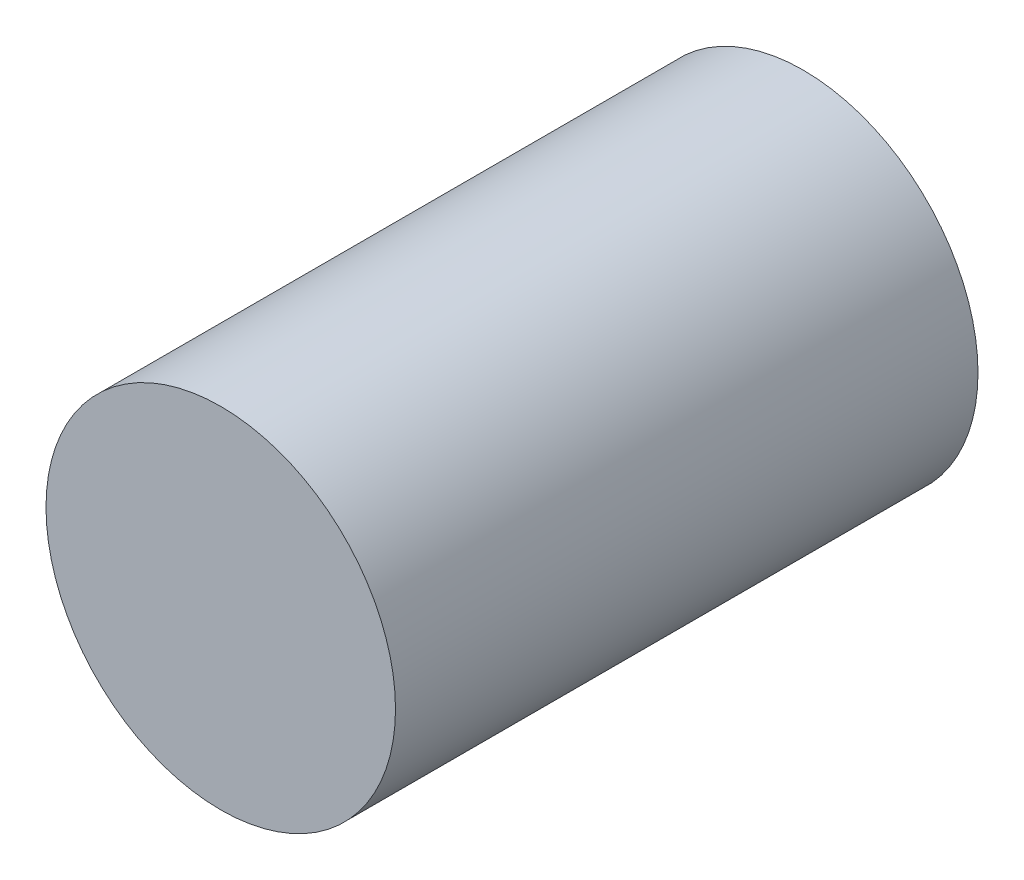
ISO-10303-21;
HEADER;
FILE_DESCRIPTION(('STEP AP214'),'2;1');
FILE_NAME('part.step','',(''),(''),'','','');
FILE_SCHEMA(('AUTOMOTIVE_DESIGN { 1 0 10303 214 1 1 1 1 }'));
ENDSEC;
DATA;
#1=APPLICATION_CONTEXT('core data for automotive mechanical design processes');
#2=APPLICATION_PROTOCOL_DEFINITION('international standard','automotive_design',2000,#1);
#3=PRODUCT_CONTEXT('',#1,'mechanical');
#4=PRODUCT('Part','Part','',(#3));
#5=PRODUCT_RELATED_PRODUCT_CATEGORY('part','',(#4));
#6=PRODUCT_DEFINITION_FORMATION('','',#4);
#7=PRODUCT_DEFINITION_CONTEXT('part definition',#1,'design');
#8=PRODUCT_DEFINITION('design','',#6,#7);
#9=PRODUCT_DEFINITION_SHAPE('','',#8);
#10=(LENGTH_UNIT() NAMED_UNIT(*) SI_UNIT(.MILLI.,.METRE.));
#11=(NAMED_UNIT(*) PLANE_ANGLE_UNIT() SI_UNIT($,.RADIAN.));
#12=(NAMED_UNIT(*) SI_UNIT($,.STERADIAN.) SOLID_ANGLE_UNIT());
#13=UNCERTAINTY_MEASURE_WITH_UNIT(LENGTH_MEASURE(1.E-05),#10,'distance_accuracy_value','');
#14=(GEOMETRIC_REPRESENTATION_CONTEXT(3) GLOBAL_UNCERTAINTY_ASSIGNED_CONTEXT((#13)) GLOBAL_UNIT_ASSIGNED_CONTEXT((#10,
#11,#12)) REPRESENTATION_CONTEXT('',''));
#15=CARTESIAN_POINT('',(0.,0.,0.));
#16=DIRECTION('',(0.,0.,1.));
#17=DIRECTION('',(1.,0.,0.));
#18=AXIS2_PLACEMENT_3D('',#15,#16,#17);
#19=CARTESIAN_POINT('',(0.,0.,10.));
#20=DIRECTION('',(0.,0.,-1.));
#21=DIRECTION('',(-1.,0.,0.));
#22=AXIS2_PLACEMENT_3D('',#19,#20,#21);
#23=CYLINDRICAL_SURFACE('',#22,3.);
#24=CARTESIAN_POINT('',(0.,0.,10.));
#25=DIRECTION('',(0.,0.,1.));
#26=DIRECTION('',(1.,0.,0.));
#27=AXIS2_PLACEMENT_3D('',#24,#25,#26);
#28=CIRCLE('',#27,3.);
#29=CARTESIAN_POINT('',(3.,0.,10.));
#30=VERTEX_POINT('',#29);
#31=EDGE_CURVE('E10',#30,#30,#28,.T.);
#32=ORIENTED_EDGE('',*,*,#31,.F.);
#33=EDGE_LOOP('',(#32));
#34=FACE_BOUND('',#33,.T.);
#35=CARTESIAN_POINT('',(0.,0.,0.));
#36=DIRECTION('',(0.,0.,1.));
#37=DIRECTION('',(1.,0.,0.));
#38=AXIS2_PLACEMENT_3D('',#35,#36,#37);
#39=CIRCLE('',#38,3.);
#40=CARTESIAN_POINT('',(3.,0.,0.));
#41=VERTEX_POINT('',#40);
#42=EDGE_CURVE('E44',#41,#41,#39,.T.);
#43=ORIENTED_EDGE('',*,*,#42,.T.);
#44=EDGE_LOOP('',(#43));
#45=FACE_BOUND('',#44,.T.);
#46=ADVANCED_FACE('F41',(#34,#45),#23,.T.);
#47=CARTESIAN_POINT('',(0.,0.,10.));
#48=DIRECTION('',(0.,0.,1.));
#49=DIRECTION('',(1.,0.,0.));
#50=AXIS2_PLACEMENT_3D('',#47,#48,#49);
#51=PLANE('',#50);
#52=ORIENTED_EDGE('',*,*,#31,.T.);
#53=EDGE_LOOP('',(#52));
#54=FACE_BOUND('',#53,.T.);
#55=ADVANCED_FACE('F56',(#54),#51,.T.);
#56=CARTESIAN_POINT('',(0.,0.,0.));
#57=DIRECTION('',(0.,0.,1.));
#58=DIRECTION('',(1.,0.,0.));
#59=AXIS2_PLACEMENT_3D('',#56,#57,#58);
#60=PLANE('',#59);
#61=ORIENTED_EDGE('',*,*,#42,.F.);
#62=EDGE_LOOP('',(#61));
#63=FACE_BOUND('',#62,.T.);
#64=ADVANCED_FACE('F54',(#63),#60,.F.);
#65=CLOSED_SHELL('',(#46,#55,#64));
#66=MANIFOLD_SOLID_BREP('B2',#65);
#67=ADVANCED_BREP_SHAPE_REPRESENTATION('',(#18,#66),#14);
#68=SHAPE_DEFINITION_REPRESENTATION(#9,#67);
ENDSEC;
END-ISO-10303-21;
